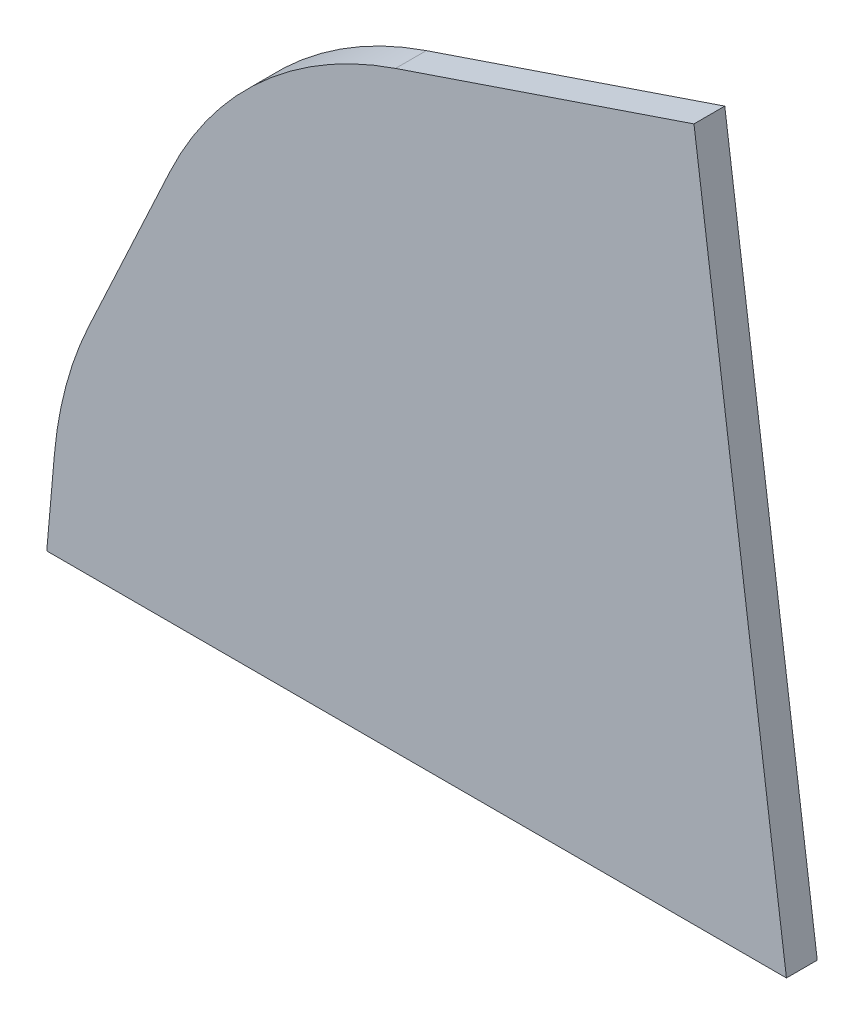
from build123d import *

# Parameters (mm, degrees)
VYSUNOUT1_DEPTH = 2
ZAOBLIT1_R      = 50


with BuildPart() as part:
    # Skica1 → Vysunout1 (new, symmetric)
    with BuildSketch(Plane.XY):
        Polygon((0, 0), (-12, 90), (-71, 70), (-94.250226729, 20), (-96, 0), align=None)
    extrude(amount=VYSUNOUT1_DEPTH, both=True)

    # Zaoblit1
    zaoblit1_edges = [part.edges().sort_by_distance(p)[0] for p in [
        (-94.250226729, 20, 0),
        (-71, 70, 0),
    ]]
    fillet(zaoblit1_edges, radius=ZAOBLIT1_R)


solid = part.part
